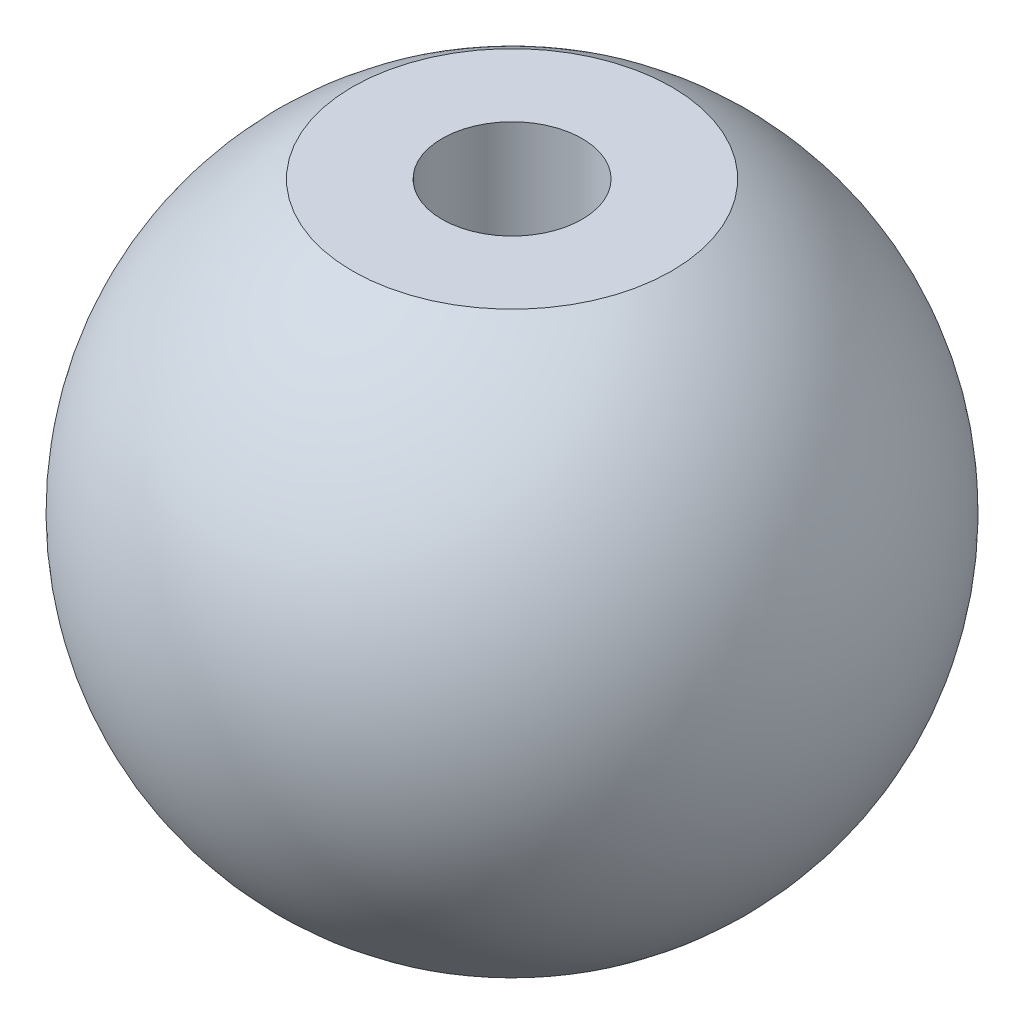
ISO-10303-21;
HEADER;
FILE_DESCRIPTION(('STEP AP214'),'2;1');
FILE_NAME('part.step','',(''),(''),'','','');
FILE_SCHEMA(('AUTOMOTIVE_DESIGN { 1 0 10303 214 1 1 1 1 }'));
ENDSEC;
DATA;
#1=APPLICATION_CONTEXT('core data for automotive mechanical design processes');
#2=APPLICATION_PROTOCOL_DEFINITION('international standard','automotive_design',2000,#1);
#3=PRODUCT_CONTEXT('',#1,'mechanical');
#4=PRODUCT('Part','Part','',(#3));
#5=PRODUCT_RELATED_PRODUCT_CATEGORY('part','',(#4));
#6=PRODUCT_DEFINITION_FORMATION('','',#4);
#7=PRODUCT_DEFINITION_CONTEXT('part definition',#1,'design');
#8=PRODUCT_DEFINITION('design','',#6,#7);
#9=PRODUCT_DEFINITION_SHAPE('','',#8);
#10=(LENGTH_UNIT() NAMED_UNIT(*) SI_UNIT(.MILLI.,.METRE.));
#11=(NAMED_UNIT(*) PLANE_ANGLE_UNIT() SI_UNIT($,.RADIAN.));
#12=(NAMED_UNIT(*) SI_UNIT($,.STERADIAN.) SOLID_ANGLE_UNIT());
#13=UNCERTAINTY_MEASURE_WITH_UNIT(LENGTH_MEASURE(1.E-05),#10,'distance_accuracy_value','');
#14=(GEOMETRIC_REPRESENTATION_CONTEXT(3) GLOBAL_UNCERTAINTY_ASSIGNED_CONTEXT((#13)) GLOBAL_UNIT_ASSIGNED_CONTEXT((#10,
#11,#12)) REPRESENTATION_CONTEXT('',''));
#15=CARTESIAN_POINT('',(0.,0.,0.));
#16=DIRECTION('',(0.,0.,1.));
#17=DIRECTION('',(1.,0.,0.));
#18=AXIS2_PLACEMENT_3D('',#15,#16,#17);
#19=CARTESIAN_POINT('',(0.,0.,0.));
#20=DIRECTION('',(0.,1.,0.));
#21=DIRECTION('',(-1.,0.,0.));
#22=AXIS2_PLACEMENT_3D('',#19,#20,#21);
#23=SPHERICAL_SURFACE('',#22,16.);
#24=CARTESIAN_POINT('',(0.,14.,0.));
#25=DIRECTION('',(0.,1.,0.));
#26=DIRECTION('',(0.,0.,1.));
#27=AXIS2_PLACEMENT_3D('',#24,#25,#26);
#28=CIRCLE('',#27,7.74596669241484);
#29=CARTESIAN_POINT('',(0.,14.,7.74596669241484));
#30=VERTEX_POINT('',#29);
#31=EDGE_CURVE('E11',#30,#30,#28,.T.);
#32=ORIENTED_EDGE('',*,*,#31,.F.);
#33=EDGE_LOOP('',(#32));
#34=FACE_BOUND('',#33,.T.);
#35=ADVANCED_FACE('F36',(#34),#23,.T.);
#36=CARTESIAN_POINT('',(-7.74596669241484,14.,0.));
#37=DIRECTION('',(0.,1.,0.));
#38=DIRECTION('',(0.,0.,1.));
#39=AXIS2_PLACEMENT_3D('',#36,#37,#38);
#40=PLANE('',#39);
#41=CARTESIAN_POINT('',(0.,14.,0.));
#42=DIRECTION('',(0.,1.,0.));
#43=DIRECTION('',(0.,0.,1.));
#44=AXIS2_PLACEMENT_3D('',#41,#42,#43);
#45=CIRCLE('',#44,3.39999999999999);
#46=CARTESIAN_POINT('',(0.,14.,3.39999999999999));
#47=VERTEX_POINT('',#46);
#48=EDGE_CURVE('E54',#47,#47,#45,.T.);
#49=ORIENTED_EDGE('',*,*,#48,.F.);
#50=EDGE_LOOP('',(#49));
#51=FACE_BOUND('',#50,.T.);
#52=ORIENTED_EDGE('',*,*,#31,.T.);
#53=EDGE_LOOP('',(#52));
#54=FACE_BOUND('',#53,.T.);
#55=ADVANCED_FACE('F49',(#51,#54),#40,.T.);
#56=CARTESIAN_POINT('',(0.,-8.25,0.));
#57=DIRECTION('',(0.,1.,0.));
#58=DIRECTION('',(0.,0.,1.));
#59=AXIS2_PLACEMENT_3D('',#56,#57,#58);
#60=CONICAL_SURFACE('',#59,3.39999999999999,1.02974425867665);
#61=CARTESIAN_POINT('',(0.,-10.2929261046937,0.));
#62=VERTEX_POINT('',#61);
#63=VERTEX_LOOP('',#62);
#64=FACE_BOUND('',#63,.T.);
#65=CARTESIAN_POINT('',(0.,-8.25,0.));
#66=DIRECTION('',(0.,1.,0.));
#67=DIRECTION('',(0.,0.,1.));
#68=AXIS2_PLACEMENT_3D('',#65,#66,#67);
#69=CIRCLE('',#68,3.39999999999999);
#70=CARTESIAN_POINT('',(0.,-8.25,3.39999999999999));
#71=VERTEX_POINT('',#70);
#72=EDGE_CURVE('E42',#71,#71,#69,.T.);
#73=ORIENTED_EDGE('',*,*,#72,.T.);
#74=EDGE_LOOP('',(#73));
#75=FACE_BOUND('',#74,.T.);
#76=ADVANCED_FACE('F45',(#64,#75),#60,.F.);
#77=CARTESIAN_POINT('',(0.,14.,0.));
#78=DIRECTION('',(0.,1.,0.));
#79=DIRECTION('',(0.,0.,1.));
#80=AXIS2_PLACEMENT_3D('',#77,#78,#79);
#81=CYLINDRICAL_SURFACE('',#80,3.39999999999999);
#82=ORIENTED_EDGE('',*,*,#72,.F.);
#83=EDGE_LOOP('',(#82));
#84=FACE_BOUND('',#83,.T.);
#85=ORIENTED_EDGE('',*,*,#48,.T.);
#86=EDGE_LOOP('',(#85));
#87=FACE_BOUND('',#86,.T.);
#88=ADVANCED_FACE('F48',(#84,#87),#81,.F.);
#89=CLOSED_SHELL('',(#35,#55,#76,#88));
#90=MANIFOLD_SOLID_BREP('B2',#89);
#91=ADVANCED_BREP_SHAPE_REPRESENTATION('',(#18,#90),#14);
#92=SHAPE_DEFINITION_REPRESENTATION(#9,#91);
ENDSEC;
END-ISO-10303-21;
